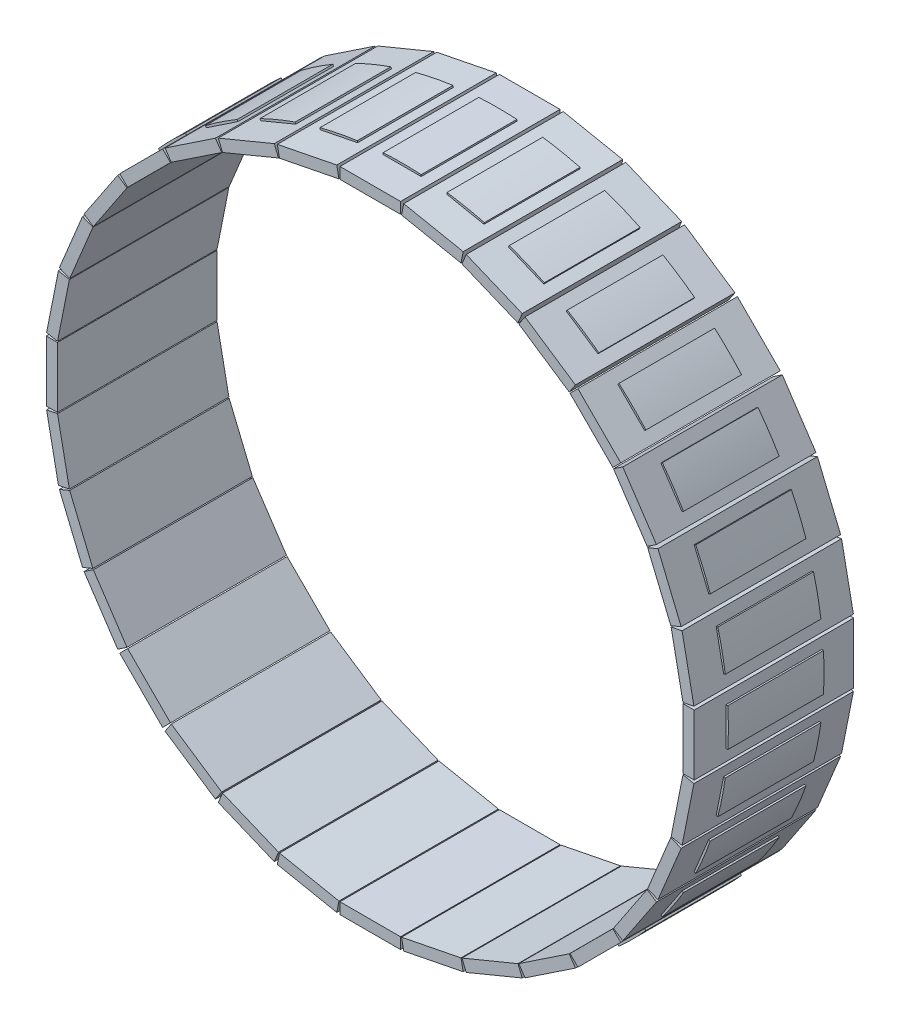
from build123d import *

# Parameters (mm, degrees)
SKETCH_1_W         = 19
SKETCH_1_H         = 3.5
EXTRUDE_1_DEPTH    = 50
EXTRUDE_1_2_DEPTH  = 50
EXTRUDE_1_3_DEPTH  = 50
EXTRUDE_1_4_DEPTH  = 50
EXTRUDE_1_5_DEPTH  = 50
EXTRUDE_1_6_DEPTH  = 50
EXTRUDE_1_7_DEPTH  = 50
EXTRUDE_1_8_DEPTH  = 50
SKETCH_1_W_2       = 3.5
SKETCH_1_H_2       = 19
EXTRUDE_1_9_DEPTH  = 50
EXTRUDE_1_10_DEPTH = 50
EXTRUDE_1_11_DEPTH = 50
EXTRUDE_1_12_DEPTH = 50
EXTRUDE_1_13_DEPTH = 50
EXTRUDE_1_14_DEPTH = 50
EXTRUDE_1_15_DEPTH = 50
EXTRUDE_1_16_DEPTH = 50
EXTRUDE_1_17_DEPTH = 50
EXTRUDE_1_18_DEPTH = 50
EXTRUDE_1_19_DEPTH = 50
EXTRUDE_1_20_DEPTH = 50
EXTRUDE_1_21_DEPTH = 50
EXTRUDE_1_22_DEPTH = 50
EXTRUDE_1_23_DEPTH = 50
EXTRUDE_1_24_DEPTH = 50
EXTRUDE_1_25_DEPTH = 50
EXTRUDE_1_26_DEPTH = 50
EXTRUDE_1_27_DEPTH = 50
EXTRUDE_1_28_DEPTH = 50
EXTRUDE_1_29_DEPTH = 50
EXTRUDE_1_30_DEPTH = 50
EXTRUDE_1_31_DEPTH = 50
EXTRUDE_1_32_DEPTH = 50
EXTRUDE_START      = -10
EXTRUDE_2_DEPTH    = 30


with BuildPart() as part:
    # Sketch 1 → Extrude 1 (new body)
    with BuildSketch(Plane.XY):
        with Locations((0, 99.806634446)):
            Rectangle(SKETCH_1_W, SKETCH_1_H)
    extrude(amount=EXTRUDE_1_DEPTH)

    # Sketch 2 → Extrude 2 (add)
    with BuildSketch(Plane.XY.offset(50).offset(EXTRUDE_START)):
        with BuildLine():
            Line((-5.965692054, 102.075819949), (-5.965692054, 100.533088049))
            Line((-5.965692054, 100.533088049), (5.965692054, 100.533088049))
            Line((5.965692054, 100.533088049), (5.965692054, 102.075819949))
            ThreePointArc((5.965692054, 102.075819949), (0, 102.25), (-5.965692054, 102.075819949))
        make_face()
        with BuildLine():
            Line((25.464095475, 97.437524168), (25.765067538, 98.950612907))
            ThreePointArc((25.765067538, 98.950612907), (19.947985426, 100.285294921), (14.06294163, 101.278310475))
            Line((14.06294163, 101.278310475), (13.761969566, 99.765221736))
            Line((13.761969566, 99.765221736), (25.464095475, 97.437524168))
        make_face()
        with BuildLine():
            Line((43.983927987, 90.597490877), (44.574305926, 92.022789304))
            ThreePointArc((44.574305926, 92.022789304), (39.129380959, 94.466682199), (33.551144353, 96.588732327))
            Line((33.551144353, 96.588732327), (32.960766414, 95.1634339))
            Line((32.960766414, 95.1634339), (43.983927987, 90.597490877))
        make_face()
        with BuildLine():
            Line((60.813482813, 80.275846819), (61.670578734, 81.558581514))
            ThreePointArc((61.670578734, 81.558581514), (56.807056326, 85.017767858), (51.749995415, 88.187303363))
            Line((51.749995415, 88.187303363), (50.892899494, 86.904568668))
            Line((50.892899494, 86.904568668), (60.813482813, 80.275846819))
        make_face()
        with BuildLine():
            Line((75.306009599, 66.869246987), (76.396885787, 67.960123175))
            ThreePointArc((76.396885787, 67.960123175), (72.301668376, 72.301668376), (67.960123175, 76.396885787))
            Line((67.960123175, 76.396885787), (66.869246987, 75.306009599))
            Line((66.869246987, 75.306009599), (75.306009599, 66.869246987))
        make_face()
        with BuildLine():
            Line((86.904568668, 50.892899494), (88.187303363, 51.749995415))
            ThreePointArc((88.187303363, 51.749995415), (85.017767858, 56.807056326), (81.558581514, 61.670578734))
            Line((81.558581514, 61.670578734), (80.275846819, 60.813482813))
            Line((80.275846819, 60.813482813), (86.904568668, 50.892899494))
        make_face()
        with BuildLine():
            Line((95.1634339, 32.960766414), (96.588732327, 33.551144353))
            ThreePointArc((96.588732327, 33.551144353), (94.466682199, 39.129380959), (92.022789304, 44.574305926))
            Line((92.022789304, 44.574305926), (90.597490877, 43.983927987))
            Line((90.597490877, 43.983927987), (95.1634339, 32.960766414))
        make_face()
        with BuildLine():
            Line((99.765221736, 13.761969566), (101.278310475, 14.06294163))
            ThreePointArc((101.278310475, 14.06294163), (100.285294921, 19.947985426), (98.950612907, 25.765067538))
            Line((98.950612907, 25.765067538), (97.437524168, 25.464095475))
            Line((97.437524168, 25.464095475), (99.765221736, 13.761969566))
        make_face()
        with BuildLine():
            Line((100.533088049, -5.965692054), (102.075819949, -5.965692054))
            ThreePointArc((102.075819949, -5.965692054), (102.25, 0), (102.075819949, 5.965692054))
            Line((102.075819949, 5.965692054), (100.533088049, 5.965692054))
            Line((100.533088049, 5.965692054), (100.533088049, -5.965692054))
        make_face()
        with BuildLine():
            Line((97.437524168, -25.464095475), (98.950612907, -25.765067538))
            ThreePointArc((98.950612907, -25.765067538), (100.285294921, -19.947985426), (101.278310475, -14.06294163))
            Line((101.278310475, -14.06294163), (99.765221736, -13.761969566))
            Line((99.765221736, -13.761969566), (97.437524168, -25.464095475))
        make_face()
        with BuildLine():
            Line((90.597490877, -43.983927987), (92.022789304, -44.574305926))
            ThreePointArc((92.022789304, -44.574305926), (94.466682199, -39.129380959), (96.588732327, -33.551144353))
            Line((96.588732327, -33.551144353), (95.1634339, -32.960766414))
            Line((95.1634339, -32.960766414), (90.597490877, -43.983927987))
        make_face()
        with BuildLine():
            Line((80.275846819, -60.813482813), (81.558581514, -61.670578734))
            ThreePointArc((81.558581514, -61.670578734), (85.017767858, -56.807056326), (88.187303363, -51.749995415))
            Line((88.187303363, -51.749995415), (86.904568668, -50.892899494))
            Line((86.904568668, -50.892899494), (80.275846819, -60.813482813))
        make_face()
        with BuildLine():
            Line((66.869246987, -75.306009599), (67.960123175, -76.396885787))
            ThreePointArc((67.960123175, -76.396885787), (72.301668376, -72.301668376), (76.396885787, -67.960123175))
            Line((76.396885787, -67.960123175), (75.306009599, -66.869246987))
            Line((75.306009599, -66.869246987), (66.869246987, -75.306009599))
        make_face()
        with BuildLine():
            Line((50.892899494, -86.904568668), (51.749995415, -88.187303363))
            ThreePointArc((51.749995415, -88.187303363), (56.807056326, -85.017767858), (61.670578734, -81.558581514))
            Line((61.670578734, -81.558581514), (60.813482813, -80.275846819))
            Line((60.813482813, -80.275846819), (50.892899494, -86.904568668))
        make_face()
        with BuildLine():
            Line((32.960766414, -95.1634339), (33.551144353, -96.588732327))
            ThreePointArc((33.551144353, -96.588732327), (39.129380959, -94.466682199), (44.574305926, -92.022789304))
            Line((44.574305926, -92.022789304), (43.983927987, -90.597490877))
            Line((43.983927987, -90.597490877), (32.960766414, -95.1634339))
        make_face()
        with BuildLine():
            Line((13.761969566, -99.765221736), (14.06294163, -101.278310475))
            ThreePointArc((14.06294163, -101.278310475), (19.947985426, -100.285294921), (25.765067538, -98.950612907))
            Line((25.765067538, -98.950612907), (25.464095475, -97.437524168))
            Line((25.464095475, -97.437524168), (13.761969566, -99.765221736))
        make_face()
        with BuildLine():
            Line((-5.965692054, -100.533088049), (-5.965692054, -102.075819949))
            ThreePointArc((-5.965692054, -102.075819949), (0, -102.25), (5.965692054, -102.075819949))
            Line((5.965692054, -102.075819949), (5.965692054, -100.533088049))
            Line((5.965692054, -100.533088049), (-5.965692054, -100.533088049))
        make_face()
        with BuildLine():
            Line((-25.464095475, -97.437524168), (-25.765067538, -98.950612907))
            ThreePointArc((-25.765067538, -98.950612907), (-19.947985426, -100.285294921), (-14.06294163, -101.278310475))
            Line((-14.06294163, -101.278310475), (-13.761969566, -99.765221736))
            Line((-13.761969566, -99.765221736), (-25.464095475, -97.437524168))
        make_face()
        with BuildLine():
            Line((-43.983927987, -90.597490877), (-44.574305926, -92.022789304))
            ThreePointArc((-44.574305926, -92.022789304), (-39.129380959, -94.466682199), (-33.551144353, -96.588732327))
            Line((-33.551144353, -96.588732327), (-32.960766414, -95.1634339))
            Line((-32.960766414, -95.1634339), (-43.983927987, -90.597490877))
        make_face()
        with BuildLine():
            Line((-60.813482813, -80.275846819), (-61.670578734, -81.558581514))
            ThreePointArc((-61.670578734, -81.558581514), (-56.807056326, -85.017767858), (-51.749995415, -88.187303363))
            Line((-51.749995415, -88.187303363), (-50.892899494, -86.904568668))
            Line((-50.892899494, -86.904568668), (-60.813482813, -80.275846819))
        make_face()
        with BuildLine():
            Line((-75.306009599, -66.869246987), (-76.396885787, -67.960123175))
            ThreePointArc((-76.396885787, -67.960123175), (-72.301668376, -72.301668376), (-67.960123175, -76.396885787))
            Line((-67.960123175, -76.396885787), (-66.869246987, -75.306009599))
            Line((-66.869246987, -75.306009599), (-75.306009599, -66.869246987))
        make_face()
        with BuildLine():
            Line((-86.904568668, -50.892899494), (-88.187303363, -51.749995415))
            ThreePointArc((-88.187303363, -51.749995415), (-85.017767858, -56.807056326), (-81.558581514, -61.670578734))
            Line((-81.558581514, -61.670578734), (-80.275846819, -60.813482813))
            Line((-80.275846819, -60.813482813), (-86.904568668, -50.892899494))
        make_face()
        with BuildLine():
            Line((-95.1634339, -32.960766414), (-96.588732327, -33.551144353))
            ThreePointArc((-96.588732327, -33.551144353), (-94.466682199, -39.129380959), (-92.022789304, -44.574305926))
            Line((-92.022789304, -44.574305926), (-90.597490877, -43.983927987))
            Line((-90.597490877, -43.983927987), (-95.1634339, -32.960766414))
        make_face()
        with BuildLine():
            Line((-99.765221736, -13.761969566), (-101.278310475, -14.06294163))
            ThreePointArc((-101.278310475, -14.06294163), (-100.285294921, -19.947985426), (-98.950612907, -25.765067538))
            Line((-98.950612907, -25.765067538), (-97.437524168, -25.464095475))
            Line((-97.437524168, -25.464095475), (-99.765221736, -13.761969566))
        make_face()
        with BuildLine():
            Line((-100.533088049, 5.965692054), (-102.075819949, 5.965692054))
            ThreePointArc((-102.075819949, 5.965692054), (-102.25, 0), (-102.075819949, -5.965692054))
            Line((-102.075819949, -5.965692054), (-100.533088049, -5.965692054))
            Line((-100.533088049, -5.965692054), (-100.533088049, 5.965692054))
        make_face()
        with BuildLine():
            Line((-97.437524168, 25.464095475), (-98.950612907, 25.765067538))
            ThreePointArc((-98.950612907, 25.765067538), (-100.285294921, 19.947985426), (-101.278310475, 14.06294163))
            Line((-101.278310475, 14.06294163), (-99.765221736, 13.761969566))
            Line((-99.765221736, 13.761969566), (-97.437524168, 25.464095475))
        make_face()
        with BuildLine():
            Line((-90.597490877, 43.983927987), (-92.022789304, 44.574305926))
            ThreePointArc((-92.022789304, 44.574305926), (-94.466682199, 39.129380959), (-96.588732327, 33.551144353))
            Line((-96.588732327, 33.551144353), (-95.1634339, 32.960766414))
            Line((-95.1634339, 32.960766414), (-90.597490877, 43.983927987))
        make_face()
        with BuildLine():
            Line((-80.275846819, 60.813482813), (-81.558581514, 61.670578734))
            ThreePointArc((-81.558581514, 61.670578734), (-85.017767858, 56.807056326), (-88.187303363, 51.749995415))
            Line((-88.187303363, 51.749995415), (-86.904568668, 50.892899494))
            Line((-86.904568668, 50.892899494), (-80.275846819, 60.813482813))
        make_face()
        with BuildLine():
            Line((-66.869246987, 75.306009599), (-67.960123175, 76.396885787))
            ThreePointArc((-67.960123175, 76.396885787), (-72.301668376, 72.301668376), (-76.396885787, 67.960123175))
            Line((-76.396885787, 67.960123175), (-75.306009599, 66.869246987))
            Line((-75.306009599, 66.869246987), (-66.869246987, 75.306009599))
        make_face()
        with BuildLine():
            Line((-50.892899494, 86.904568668), (-51.749995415, 88.187303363))
            ThreePointArc((-51.749995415, 88.187303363), (-56.807056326, 85.017767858), (-61.670578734, 81.558581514))
            Line((-61.670578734, 81.558581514), (-60.813482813, 80.275846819))
            Line((-60.813482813, 80.275846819), (-50.892899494, 86.904568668))
        make_face()
        with BuildLine():
            Line((-32.960766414, 95.1634339), (-33.551144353, 96.588732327))
            ThreePointArc((-33.551144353, 96.588732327), (-39.129380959, 94.466682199), (-44.574305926, 92.022789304))
            Line((-44.574305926, 92.022789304), (-43.983927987, 90.597490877))
            Line((-43.983927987, 90.597490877), (-32.960766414, 95.1634339))
        make_face()
        with BuildLine():
            Line((-13.761969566, 99.765221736), (-14.06294163, 101.278310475))
            ThreePointArc((-14.06294163, 101.278310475), (-19.947985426, 100.285294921), (-25.765067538, 98.950612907))
            Line((-25.765067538, 98.950612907), (-25.464095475, 97.437524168))
            Line((-25.464095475, 97.437524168), (-13.761969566, 99.765221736))
        make_face()
    extrude(amount=-EXTRUDE_2_DEPTH)


with BuildPart() as body_2:
    # Sketch 1 → Extrude 1 2 (new body)
    with BuildSketch(Plane.XY):
        Polygon((10.495256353, 101.458610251), (9.812440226, 98.02586177), (28.447360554, 94.319145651), (29.130176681, 97.751894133), align=None)
    extrude(amount=EXTRUDE_1_2_DEPTH)


with BuildPart() as body_3:
    # Sketch 1 → Extrude 1 3 (new body)
    with BuildSketch(Plane.XY):
        Polygon((30.08718589, 97.461588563), (28.747793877, 94.228010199), (46.301504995, 86.957024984), (47.640897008, 90.190603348), align=None)
    extrude(amount=EXTRUDE_1_3_DEPTH)


with BuildPart() as body_4:
    # Sketch 1 → Extrude 1 4 (new body)
    with BuildSketch(Plane.XY):
        Polygon((48.522881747, 89.719172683), (46.578385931, 86.80902904), (62.376308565, 76.253194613), (64.320804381, 79.163338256), align=None)
    extrude(amount=EXTRUDE_1_4_DEPTH)


with BuildPart() as body_5:
    # Sketch 1 → Extrude 1 5 (new body)
    with BuildSketch(Plane.XY):
        Polygon((65.09387047, 78.528899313), (62.618996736, 76.054025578), (76.054025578, 62.618996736), (78.528899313, 65.09387047), align=None)
    extrude(amount=EXTRUDE_1_5_DEPTH)


with BuildPart() as body_6:
    # Sketch 1 → Extrude 1 6 (new body)
    with BuildSketch(Plane.XY):
        Polygon((79.163338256, 64.320804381), (76.253194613, 62.376308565), (86.80902904, 46.578385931), (89.719172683, 48.522881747), align=None)
    extrude(amount=EXTRUDE_1_6_DEPTH)


with BuildPart() as body_7:
    # Sketch 1 → Extrude 1 7 (new body)
    with BuildSketch(Plane.XY):
        Polygon((90.190603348, 47.640897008), (86.957024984, 46.301504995), (94.228010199, 28.747793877), (97.461588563, 30.08718589), align=None)
    extrude(amount=EXTRUDE_1_7_DEPTH)


with BuildPart() as body_8:
    # Sketch 1 → Extrude 1 8 (new body)
    with BuildSketch(Plane.XY):
        Polygon((97.751894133, 29.130176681), (94.319145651, 28.447360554), (98.02586177, 9.812440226), (101.458610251, 10.495256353), align=None)
    extrude(amount=EXTRUDE_1_8_DEPTH)


with BuildPart() as body_9:
    # Sketch 1 → Extrude 1 9 (new body)
    with BuildSketch(Plane.XY):
        with Locations((99.806634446, 0)):
            Rectangle(SKETCH_1_W_2, SKETCH_1_H_2)
    extrude(amount=EXTRUDE_1_9_DEPTH)


with BuildPart() as body_10:
    # Sketch 1 → Extrude 1 10 (new body)
    with BuildSketch(Plane.XY):
        Polygon((101.458610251, -10.495256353), (98.02586177, -9.812440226), (94.319145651, -28.447360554), (97.751894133, -29.130176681), align=None)
    extrude(amount=EXTRUDE_1_10_DEPTH)


with BuildPart() as body_11:
    # Sketch 1 → Extrude 1 11 (new body)
    with BuildSketch(Plane.XY):
        Polygon((97.461588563, -30.08718589), (94.228010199, -28.747793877), (86.957024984, -46.301504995), (90.190603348, -47.640897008), align=None)
    extrude(amount=EXTRUDE_1_11_DEPTH)


with BuildPart() as body_12:
    # Sketch 1 → Extrude 1 12 (new body)
    with BuildSketch(Plane.XY):
        Polygon((89.719172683, -48.522881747), (86.80902904, -46.578385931), (76.253194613, -62.376308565), (79.163338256, -64.320804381), align=None)
    extrude(amount=EXTRUDE_1_12_DEPTH)


with BuildPart() as body_13:
    # Sketch 1 → Extrude 1 13 (new body)
    with BuildSketch(Plane.XY):
        Polygon((78.528899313, -65.09387047), (76.054025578, -62.618996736), (62.618996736, -76.054025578), (65.09387047, -78.528899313), align=None)
    extrude(amount=EXTRUDE_1_13_DEPTH)


with BuildPart() as body_14:
    # Sketch 1 → Extrude 1 14 (new body)
    with BuildSketch(Plane.XY):
        Polygon((64.320804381, -79.163338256), (62.376308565, -76.253194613), (46.578385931, -86.80902904), (48.522881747, -89.719172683), align=None)
    extrude(amount=EXTRUDE_1_14_DEPTH)


with BuildPart() as body_15:
    # Sketch 1 → Extrude 1 15 (new body)
    with BuildSketch(Plane.XY):
        Polygon((47.640897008, -90.190603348), (46.301504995, -86.957024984), (28.747793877, -94.228010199), (30.08718589, -97.461588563), align=None)
    extrude(amount=EXTRUDE_1_15_DEPTH)


with BuildPart() as body_16:
    # Sketch 1 → Extrude 1 16 (new body)
    with BuildSketch(Plane.XY):
        Polygon((29.130176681, -97.751894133), (28.447360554, -94.319145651), (9.812440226, -98.02586177), (10.495256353, -101.458610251), align=None)
    extrude(amount=EXTRUDE_1_16_DEPTH)


with BuildPart() as body_17:
    # Sketch 1 → Extrude 1 17 (new body)
    with BuildSketch(Plane.XY):
        with Locations((0, -99.806634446)):
            Rectangle(SKETCH_1_W, SKETCH_1_H)
    extrude(amount=EXTRUDE_1_17_DEPTH)


with BuildPart() as body_18:
    # Sketch 1 → Extrude 1 18 (new body)
    with BuildSketch(Plane.XY):
        Polygon((-10.495256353, -101.458610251), (-9.812440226, -98.02586177), (-28.447360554, -94.319145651), (-29.130176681, -97.751894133), align=None)
    extrude(amount=EXTRUDE_1_18_DEPTH)


with BuildPart() as body_19:
    # Sketch 1 → Extrude 1 19 (new body)
    with BuildSketch(Plane.XY):
        Polygon((-30.08718589, -97.461588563), (-28.747793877, -94.228010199), (-46.301504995, -86.957024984), (-47.640897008, -90.190603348), align=None)
    extrude(amount=EXTRUDE_1_19_DEPTH)


with BuildPart() as body_20:
    # Sketch 1 → Extrude 1 20 (new body)
    with BuildSketch(Plane.XY):
        Polygon((-48.522881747, -89.719172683), (-46.578385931, -86.80902904), (-62.376308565, -76.253194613), (-64.320804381, -79.163338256), align=None)
    extrude(amount=EXTRUDE_1_20_DEPTH)


with BuildPart() as body_21:
    # Sketch 1 → Extrude 1 21 (new body)
    with BuildSketch(Plane.XY):
        Polygon((-65.09387047, -78.528899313), (-62.618996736, -76.054025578), (-76.054025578, -62.618996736), (-78.528899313, -65.09387047), align=None)
    extrude(amount=EXTRUDE_1_21_DEPTH)


with BuildPart() as body_22:
    # Sketch 1 → Extrude 1 22 (new body)
    with BuildSketch(Plane.XY):
        Polygon((-79.163338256, -64.320804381), (-76.253194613, -62.376308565), (-86.80902904, -46.578385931), (-89.719172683, -48.522881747), align=None)
    extrude(amount=EXTRUDE_1_22_DEPTH)


with BuildPart() as body_23:
    # Sketch 1 → Extrude 1 23 (new body)
    with BuildSketch(Plane.XY):
        Polygon((-90.190603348, -47.640897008), (-86.957024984, -46.301504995), (-94.228010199, -28.747793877), (-97.461588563, -30.08718589), align=None)
    extrude(amount=EXTRUDE_1_23_DEPTH)


with BuildPart() as body_24:
    # Sketch 1 → Extrude 1 24 (new body)
    with BuildSketch(Plane.XY):
        Polygon((-97.751894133, -29.130176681), (-94.319145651, -28.447360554), (-98.02586177, -9.812440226), (-101.458610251, -10.495256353), align=None)
    extrude(amount=EXTRUDE_1_24_DEPTH)


with BuildPart() as body_25:
    # Sketch 1 → Extrude 1 25 (new body)
    with BuildSketch(Plane.XY):
        with Locations((-99.806634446, 0)):
            Rectangle(SKETCH_1_W_2, SKETCH_1_H_2)
    extrude(amount=EXTRUDE_1_25_DEPTH)


with BuildPart() as body_26:
    # Sketch 1 → Extrude 1 26 (new body)
    with BuildSketch(Plane.XY):
        Polygon((-101.458610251, 10.495256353), (-98.02586177, 9.812440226), (-94.319145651, 28.447360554), (-97.751894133, 29.130176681), align=None)
    extrude(amount=EXTRUDE_1_26_DEPTH)


with BuildPart() as body_27:
    # Sketch 1 → Extrude 1 27 (new body)
    with BuildSketch(Plane.XY):
        Polygon((-97.461588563, 30.08718589), (-94.228010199, 28.747793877), (-86.957024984, 46.301504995), (-90.190603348, 47.640897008), align=None)
    extrude(amount=EXTRUDE_1_27_DEPTH)


with BuildPart() as body_28:
    # Sketch 1 → Extrude 1 28 (new body)
    with BuildSketch(Plane.XY):
        Polygon((-89.719172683, 48.522881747), (-86.80902904, 46.578385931), (-76.253194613, 62.376308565), (-79.163338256, 64.320804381), align=None)
    extrude(amount=EXTRUDE_1_28_DEPTH)


with BuildPart() as body_29:
    # Sketch 1 → Extrude 1 29 (new body)
    with BuildSketch(Plane.XY):
        Polygon((-78.528899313, 65.09387047), (-76.054025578, 62.618996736), (-62.618996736, 76.054025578), (-65.09387047, 78.528899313), align=None)
    extrude(amount=EXTRUDE_1_29_DEPTH)


with BuildPart() as body_30:
    # Sketch 1 → Extrude 1 30 (new body)
    with BuildSketch(Plane.XY):
        Polygon((-64.320804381, 79.163338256), (-62.376308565, 76.253194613), (-46.578385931, 86.80902904), (-48.522881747, 89.719172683), align=None)
    extrude(amount=EXTRUDE_1_30_DEPTH)


with BuildPart() as body_31:
    # Sketch 1 → Extrude 1 31 (new body)
    with BuildSketch(Plane.XY):
        Polygon((-47.640897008, 90.190603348), (-46.301504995, 86.957024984), (-28.747793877, 94.228010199), (-30.08718589, 97.461588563), align=None)
    extrude(amount=EXTRUDE_1_31_DEPTH)


with BuildPart() as body_32:
    # Sketch 1 → Extrude 1 32 (new body)
    with BuildSketch(Plane.XY):
        Polygon((-29.130176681, 97.751894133), (-28.447360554, 94.319145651), (-9.812440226, 98.02586177), (-10.495256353, 101.458610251), align=None)
    extrude(amount=EXTRUDE_1_32_DEPTH)


solid = Compound([part.part, body_2.part, body_3.part, body_4.part, body_5.part, body_6.part, body_7.part, body_8.part, body_9.part, body_10.part, body_11.part, body_12.part, body_13.part, body_14.part, body_15.part, body_16.part, body_17.part, body_18.part, body_19.part, body_20.part, body_21.part, body_22.part, body_23.part, body_24.part, body_25.part, body_26.part, body_27.part, body_28.part, body_29.part, body_30.part, body_31.part, body_32.part])
